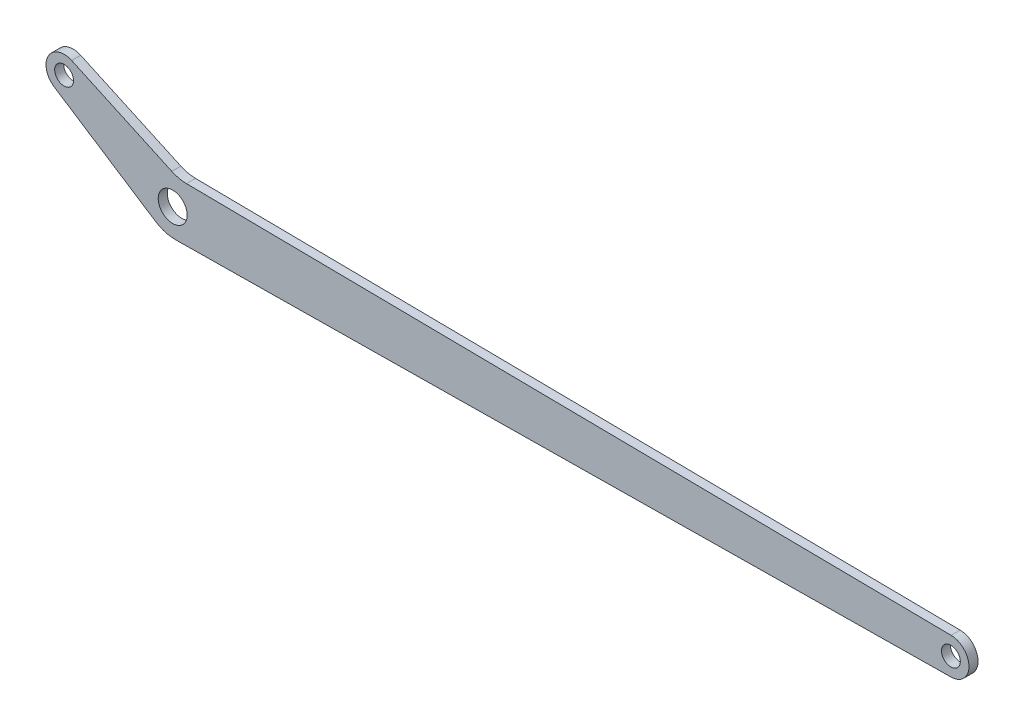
ISO-10303-21;
HEADER;
FILE_DESCRIPTION(('STEP AP214'),'2;1');
FILE_NAME('part.step','',(''),(''),'','','');
FILE_SCHEMA(('AUTOMOTIVE_DESIGN { 1 0 10303 214 1 1 1 1 }'));
ENDSEC;
DATA;
#1=APPLICATION_CONTEXT('core data for automotive mechanical design processes');
#2=APPLICATION_PROTOCOL_DEFINITION('international standard','automotive_design',2000,#1);
#3=PRODUCT_CONTEXT('',#1,'mechanical');
#4=PRODUCT('Part','Part','',(#3));
#5=PRODUCT_RELATED_PRODUCT_CATEGORY('part','',(#4));
#6=PRODUCT_DEFINITION_FORMATION('','',#4);
#7=PRODUCT_DEFINITION_CONTEXT('part definition',#1,'design');
#8=PRODUCT_DEFINITION('design','',#6,#7);
#9=PRODUCT_DEFINITION_SHAPE('','',#8);
#10=(LENGTH_UNIT() NAMED_UNIT(*) SI_UNIT(.MILLI.,.METRE.));
#11=(NAMED_UNIT(*) PLANE_ANGLE_UNIT() SI_UNIT($,.RADIAN.));
#12=(NAMED_UNIT(*) SI_UNIT($,.STERADIAN.) SOLID_ANGLE_UNIT());
#13=UNCERTAINTY_MEASURE_WITH_UNIT(LENGTH_MEASURE(1.E-05),#10,'distance_accuracy_value','');
#14=(GEOMETRIC_REPRESENTATION_CONTEXT(3) GLOBAL_UNCERTAINTY_ASSIGNED_CONTEXT((#13)) GLOBAL_UNIT_ASSIGNED_CONTEXT((#10,
#11,#12)) REPRESENTATION_CONTEXT('',''));
#15=CARTESIAN_POINT('',(0.,0.,0.));
#16=DIRECTION('',(0.,0.,1.));
#17=DIRECTION('',(1.,0.,0.));
#18=AXIS2_PLACEMENT_3D('',#15,#16,#17);
#19=CARTESIAN_POINT('',(0.,0.,2.5));
#20=DIRECTION('',(0.,0.,1.));
#21=DIRECTION('',(1.,0.,0.));
#22=AXIS2_PLACEMENT_3D('',#19,#20,#21);
#23=PLANE('',#22);
#24=CARTESIAN_POINT('',(-215.,0.,2.5));
#25=DIRECTION('',(0.,0.,1.));
#26=DIRECTION('',(1.,0.,0.));
#27=AXIS2_PLACEMENT_3D('',#24,#25,#26);
#28=CIRCLE('',#27,3.99999999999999);
#29=CARTESIAN_POINT('',(-211.,0.,2.5));
#30=VERTEX_POINT('',#29);
#31=EDGE_CURVE('E178',#30,#30,#28,.T.);
#32=ORIENTED_EDGE('',*,*,#31,.F.);
#33=EDGE_LOOP('',(#32));
#34=FACE_BOUND('',#33,.T.);
#35=DIRECTION('',(0.838688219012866,-0.54461185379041,0.));
#36=VECTOR('',#35,1.);
#37=CARTESIAN_POINT('',(-247.723059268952,12.3065589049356,2.5));
#38=LINE('',#37,#36);
#39=CARTESIAN_POINT('',(-247.723059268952,12.3065589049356,2.5));
#40=VERTEX_POINT('',#39);
#41=CARTESIAN_POINT('',(-219.718911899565,-5.87825669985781,2.5));
#42=VERTEX_POINT('',#41);
#43=EDGE_CURVE('E158',#40,#42,#38,.T.);
#44=ORIENTED_EDGE('',*,*,#43,.T.);
#45=CARTESIAN_POINT('',(-214.272793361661,2.50862549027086,2.5));
#46=DIRECTION('',(0.,0.,1.));
#47=DIRECTION('',(1.,0.,0.));
#48=AXIS2_PLACEMENT_3D('',#45,#46,#47);
#49=CIRCLE('',#48,10.);
#50=CARTESIAN_POINT('',(-214.156514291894,-7.49069844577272,2.5));
#51=VERTEX_POINT('',#50);
#52=EDGE_CURVE('E11',#42,#51,#49,.T.);
#53=ORIENTED_EDGE('',*,*,#52,.T.);
#54=DIRECTION('',(0.999932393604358,0.0116279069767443,0.));
#55=VECTOR('',#54,1.);
#56=CARTESIAN_POINT('',(-217.181619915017,-7.5258764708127,2.5));
#57=LINE('',#56,#55);
#58=CARTESIAN_POINT('',(0.0581395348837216,-4.99966196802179,2.5));
#59=VERTEX_POINT('',#58);
#60=EDGE_CURVE('E114',#51,#59,#57,.T.);
#61=ORIENTED_EDGE('',*,*,#60,.T.);
#62=CARTESIAN_POINT('',(0.,0.,2.5));
#63=DIRECTION('',(0.,0.,1.));
#64=DIRECTION('',(1.,0.,0.));
#65=AXIS2_PLACEMENT_3D('',#62,#63,#64);
#66=CIRCLE('',#65,5.);
#67=CARTESIAN_POINT('',(0.0581395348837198,4.99966196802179,2.5));
#68=VERTEX_POINT('',#67);
#69=EDGE_CURVE('E109',#59,#68,#66,.T.);
#70=ORIENTED_EDGE('',*,*,#69,.T.);
#71=DIRECTION('',(-0.999932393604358,0.0116279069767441,0.));
#72=VECTOR('',#71,1.);
#73=CARTESIAN_POINT('',(-213.321651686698,7.48099008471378,2.5));
#74=LINE('',#73,#72);
#75=CARTESIAN_POINT('',(-211.200133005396,7.45631959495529,2.5));
#76=VERTEX_POINT('',#75);
#77=EDGE_CURVE('E97',#68,#76,#74,.T.);
#78=ORIENTED_EDGE('',*,*,#77,.T.);
#79=CARTESIAN_POINT('',(-211.083853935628,17.4556435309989,2.5));
#80=DIRECTION('',(0.,0.,1.));
#81=DIRECTION('',(1.,0.,0.));
#82=AXIS2_PLACEMENT_3D('',#79,#80,#81);
#83=CIRCLE('',#82,10.);
#84=CARTESIAN_POINT('',(-215.250381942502,8.36498654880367,2.5));
#85=VERTEX_POINT('',#84);
#86=EDGE_CURVE('E136',#76,#85,#83,.F.);
#87=ORIENTED_EDGE('',*,*,#86,.T.);
#88=DIRECTION('',(-0.90906569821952,0.416652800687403,0.));
#89=VECTOR('',#88,1.);
#90=CARTESIAN_POINT('',(-242.916735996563,21.0453284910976,2.5));
#91=LINE('',#90,#89);
#92=CARTESIAN_POINT('',(-242.916735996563,21.0453284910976,2.5));
#93=VERTEX_POINT('',#92);
#94=EDGE_CURVE('E108',#85,#93,#91,.T.);
#95=ORIENTED_EDGE('',*,*,#94,.T.);
#96=CARTESIAN_POINT('',(-245.,16.5,2.5));
#97=DIRECTION('',(0.,0.,1.));
#98=DIRECTION('',(1.,0.,0.));
#99=AXIS2_PLACEMENT_3D('',#96,#97,#98);
#100=CIRCLE('',#99,5.);
#101=EDGE_CURVE('E172',#93,#40,#100,.T.);
#102=ORIENTED_EDGE('',*,*,#101,.T.);
#103=EDGE_LOOP('',(#44,#53,#61,#70,#78,#87,#95,#102));
#104=FACE_BOUND('',#103,.T.);
#105=CARTESIAN_POINT('',(0.,0.,2.5));
#106=DIRECTION('',(0.,0.,1.));
#107=DIRECTION('',(1.,0.,0.));
#108=AXIS2_PLACEMENT_3D('',#105,#106,#107);
#109=CIRCLE('',#108,2.6);
#110=CARTESIAN_POINT('',(2.6,0.,2.5));
#111=VERTEX_POINT('',#110);
#112=EDGE_CURVE('E169',#111,#111,#109,.T.);
#113=ORIENTED_EDGE('',*,*,#112,.F.);
#114=EDGE_LOOP('',(#113));
#115=FACE_BOUND('',#114,.T.);
#116=CARTESIAN_POINT('',(-245.,16.5,2.5));
#117=DIRECTION('',(0.,0.,1.));
#118=DIRECTION('',(1.,0.,0.));
#119=AXIS2_PLACEMENT_3D('',#116,#117,#118);
#120=CIRCLE('',#119,2.59999999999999);
#121=CARTESIAN_POINT('',(-242.4,16.5,2.5));
#122=VERTEX_POINT('',#121);
#123=EDGE_CURVE('E184',#122,#122,#120,.T.);
#124=ORIENTED_EDGE('',*,*,#123,.F.);
#125=EDGE_LOOP('',(#124));
#126=FACE_BOUND('',#125,.T.);
#127=ADVANCED_FACE('F32',(#34,#104,#115,#126),#23,.T.);
#128=CARTESIAN_POINT('',(0.,0.,0.));
#129=DIRECTION('',(0.,0.,1.));
#130=DIRECTION('',(1.,0.,0.));
#131=AXIS2_PLACEMENT_3D('',#128,#129,#130);
#132=PLANE('',#131);
#133=DIRECTION('',(0.999932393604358,0.0116279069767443,0.));
#134=VECTOR('',#133,1.);
#135=CARTESIAN_POINT('',(-217.181619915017,-7.5258764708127,0.));
#136=LINE('',#135,#134);
#137=CARTESIAN_POINT('',(-214.156514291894,-7.49069844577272,0.));
#138=VERTEX_POINT('',#137);
#139=CARTESIAN_POINT('',(0.0581395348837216,-4.99966196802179,0.));
#140=VERTEX_POINT('',#139);
#141=EDGE_CURVE('E118',#138,#140,#136,.T.);
#142=ORIENTED_EDGE('',*,*,#141,.F.);
#143=CARTESIAN_POINT('',(-214.272793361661,2.50862549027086,0.));
#144=DIRECTION('',(0.,0.,1.));
#145=DIRECTION('',(1.,0.,0.));
#146=AXIS2_PLACEMENT_3D('',#143,#144,#145);
#147=CIRCLE('',#146,10.);
#148=CARTESIAN_POINT('',(-219.718911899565,-5.87825669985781,0.));
#149=VERTEX_POINT('',#148);
#150=EDGE_CURVE('E54',#138,#149,#147,.F.);
#151=ORIENTED_EDGE('',*,*,#150,.T.);
#152=DIRECTION('',(0.838688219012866,-0.54461185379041,0.));
#153=VECTOR('',#152,1.);
#154=CARTESIAN_POINT('',(-247.723059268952,12.3065589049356,0.));
#155=LINE('',#154,#153);
#156=CARTESIAN_POINT('',(-247.723059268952,12.3065589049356,0.));
#157=VERTEX_POINT('',#156);
#158=EDGE_CURVE('E148',#157,#149,#155,.T.);
#159=ORIENTED_EDGE('',*,*,#158,.F.);
#160=CARTESIAN_POINT('',(-245.,16.5,0.));
#161=DIRECTION('',(0.,0.,1.));
#162=DIRECTION('',(1.,0.,0.));
#163=AXIS2_PLACEMENT_3D('',#160,#161,#162);
#164=CIRCLE('',#163,5.);
#165=CARTESIAN_POINT('',(-242.916735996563,21.0453284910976,0.));
#166=VERTEX_POINT('',#165);
#167=EDGE_CURVE('E150',#166,#157,#164,.T.);
#168=ORIENTED_EDGE('',*,*,#167,.F.);
#169=DIRECTION('',(-0.90906569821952,0.416652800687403,0.));
#170=VECTOR('',#169,1.);
#171=CARTESIAN_POINT('',(-242.916735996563,21.0453284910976,0.));
#172=LINE('',#171,#170);
#173=CARTESIAN_POINT('',(-215.250381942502,8.36498654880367,0.));
#174=VERTEX_POINT('',#173);
#175=EDGE_CURVE('E163',#174,#166,#172,.T.);
#176=ORIENTED_EDGE('',*,*,#175,.F.);
#177=CARTESIAN_POINT('',(-211.083853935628,17.4556435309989,0.));
#178=DIRECTION('',(0.,0.,1.));
#179=DIRECTION('',(1.,0.,0.));
#180=AXIS2_PLACEMENT_3D('',#177,#178,#179);
#181=CIRCLE('',#180,10.);
#182=CARTESIAN_POINT('',(-211.200133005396,7.45631959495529,0.));
#183=VERTEX_POINT('',#182);
#184=EDGE_CURVE('E134',#174,#183,#181,.T.);
#185=ORIENTED_EDGE('',*,*,#184,.T.);
#186=DIRECTION('',(-0.999932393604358,0.0116279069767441,0.));
#187=VECTOR('',#186,1.);
#188=CARTESIAN_POINT('',(-213.321651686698,7.48099008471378,0.));
#189=LINE('',#188,#187);
#190=CARTESIAN_POINT('',(0.0581395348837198,4.99966196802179,0.));
#191=VERTEX_POINT('',#190);
#192=EDGE_CURVE('E164',#191,#183,#189,.T.);
#193=ORIENTED_EDGE('',*,*,#192,.F.);
#194=CARTESIAN_POINT('',(0.,0.,0.));
#195=DIRECTION('',(0.,0.,1.));
#196=DIRECTION('',(1.,0.,0.));
#197=AXIS2_PLACEMENT_3D('',#194,#195,#196);
#198=CIRCLE('',#197,5.);
#199=EDGE_CURVE('E122',#140,#191,#198,.T.);
#200=ORIENTED_EDGE('',*,*,#199,.F.);
#201=EDGE_LOOP('',(#142,#151,#159,#168,#176,#185,#193,#200));
#202=FACE_BOUND('',#201,.T.);
#203=CARTESIAN_POINT('',(0.,0.,0.));
#204=DIRECTION('',(0.,0.,1.));
#205=DIRECTION('',(1.,0.,0.));
#206=AXIS2_PLACEMENT_3D('',#203,#204,#205);
#207=CIRCLE('',#206,2.6);
#208=CARTESIAN_POINT('',(2.6,0.,0.));
#209=VERTEX_POINT('',#208);
#210=EDGE_CURVE('E175',#209,#209,#207,.T.);
#211=ORIENTED_EDGE('',*,*,#210,.T.);
#212=EDGE_LOOP('',(#211));
#213=FACE_BOUND('',#212,.T.);
#214=CARTESIAN_POINT('',(-215.,0.,0.));
#215=DIRECTION('',(0.,0.,1.));
#216=DIRECTION('',(1.,0.,0.));
#217=AXIS2_PLACEMENT_3D('',#214,#215,#216);
#218=CIRCLE('',#217,3.99999999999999);
#219=CARTESIAN_POINT('',(-211.,0.,0.));
#220=VERTEX_POINT('',#219);
#221=EDGE_CURVE('E181',#220,#220,#218,.T.);
#222=ORIENTED_EDGE('',*,*,#221,.T.);
#223=EDGE_LOOP('',(#222));
#224=FACE_BOUND('',#223,.T.);
#225=CARTESIAN_POINT('',(-245.,16.5,0.));
#226=DIRECTION('',(0.,0.,1.));
#227=DIRECTION('',(1.,0.,0.));
#228=AXIS2_PLACEMENT_3D('',#225,#226,#227);
#229=CIRCLE('',#228,2.59999999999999);
#230=CARTESIAN_POINT('',(-242.4,16.5,0.));
#231=VERTEX_POINT('',#230);
#232=EDGE_CURVE('E187',#231,#231,#229,.T.);
#233=ORIENTED_EDGE('',*,*,#232,.T.);
#234=EDGE_LOOP('',(#233));
#235=FACE_BOUND('',#234,.T.);
#236=ADVANCED_FACE('F146',(#202,#213,#224,#235),#132,.F.);
#237=CARTESIAN_POINT('',(0.,0.,2.5));
#238=DIRECTION('',(0.,0.,-1.));
#239=DIRECTION('',(-1.,0.,0.));
#240=AXIS2_PLACEMENT_3D('',#237,#238,#239);
#241=CYLINDRICAL_SURFACE('',#240,5.);
#242=ORIENTED_EDGE('',*,*,#199,.T.);
#243=DIRECTION('',(0.,0.,-1.));
#244=VECTOR('',#243,1.);
#245=CARTESIAN_POINT('',(0.0581395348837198,4.99966196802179,2.5));
#246=LINE('',#245,#244);
#247=EDGE_CURVE('E102',#68,#191,#246,.T.);
#248=ORIENTED_EDGE('',*,*,#247,.F.);
#249=ORIENTED_EDGE('',*,*,#69,.F.);
#250=DIRECTION('',(0.,0.,-1.));
#251=VECTOR('',#250,1.);
#252=CARTESIAN_POINT('',(0.0581395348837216,-4.99966196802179,2.5));
#253=LINE('',#252,#251);
#254=EDGE_CURVE('E154',#59,#140,#253,.T.);
#255=ORIENTED_EDGE('',*,*,#254,.T.);
#256=EDGE_LOOP('',(#242,#248,#249,#255));
#257=FACE_BOUND('',#256,.T.);
#258=ADVANCED_FACE('F120',(#257),#241,.T.);
#259=CARTESIAN_POINT('',(-213.321651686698,7.48099008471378,2.5));
#260=DIRECTION('',(-0.0116279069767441,-0.999932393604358,0.));
#261=DIRECTION('',(0.999932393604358,-0.0116279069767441,0.));
#262=AXIS2_PLACEMENT_3D('',#259,#260,#261);
#263=PLANE('',#262);
#264=ORIENTED_EDGE('',*,*,#192,.T.);
#265=DIRECTION('',(0.,0.,-1.));
#266=VECTOR('',#265,1.);
#267=CARTESIAN_POINT('',(-211.200133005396,7.45631959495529,2.5));
#268=LINE('',#267,#266);
#269=EDGE_CURVE('E105',#183,#76,#268,.F.);
#270=ORIENTED_EDGE('',*,*,#269,.T.);
#271=ORIENTED_EDGE('',*,*,#77,.F.);
#272=ORIENTED_EDGE('',*,*,#247,.T.);
#273=EDGE_LOOP('',(#264,#270,#271,#272));
#274=FACE_BOUND('',#273,.T.);
#275=ADVANCED_FACE('F100',(#274),#263,.F.);
#276=CARTESIAN_POINT('',(-242.916735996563,21.0453284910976,2.5));
#277=DIRECTION('',(-0.416652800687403,-0.90906569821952,0.));
#278=DIRECTION('',(0.90906569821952,-0.416652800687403,0.));
#279=AXIS2_PLACEMENT_3D('',#276,#277,#278);
#280=PLANE('',#279);
#281=ORIENTED_EDGE('',*,*,#94,.F.);
#282=DIRECTION('',(0.,0.,-1.));
#283=VECTOR('',#282,1.);
#284=CARTESIAN_POINT('',(-215.250381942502,8.36498654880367,0.));
#285=LINE('',#284,#283);
#286=EDGE_CURVE('E123',#85,#174,#285,.T.);
#287=ORIENTED_EDGE('',*,*,#286,.T.);
#288=ORIENTED_EDGE('',*,*,#175,.T.);
#289=DIRECTION('',(0.,0.,-1.));
#290=VECTOR('',#289,1.);
#291=CARTESIAN_POINT('',(-242.916735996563,21.0453284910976,2.5));
#292=LINE('',#291,#290);
#293=EDGE_CURVE('E124',#93,#166,#292,.T.);
#294=ORIENTED_EDGE('',*,*,#293,.F.);
#295=EDGE_LOOP('',(#281,#287,#288,#294));
#296=FACE_BOUND('',#295,.T.);
#297=ADVANCED_FACE('F215',(#296),#280,.F.);
#298=CARTESIAN_POINT('',(-245.,16.5,2.5));
#299=DIRECTION('',(0.,0.,-1.));
#300=DIRECTION('',(-1.,0.,0.));
#301=AXIS2_PLACEMENT_3D('',#298,#299,#300);
#302=CYLINDRICAL_SURFACE('',#301,5.);
#303=ORIENTED_EDGE('',*,*,#167,.T.);
#304=DIRECTION('',(0.,0.,-1.));
#305=VECTOR('',#304,1.);
#306=CARTESIAN_POINT('',(-247.723059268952,12.3065589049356,2.5));
#307=LINE('',#306,#305);
#308=EDGE_CURVE('E129',#40,#157,#307,.T.);
#309=ORIENTED_EDGE('',*,*,#308,.F.);
#310=ORIENTED_EDGE('',*,*,#101,.F.);
#311=ORIENTED_EDGE('',*,*,#293,.T.);
#312=EDGE_LOOP('',(#303,#309,#310,#311));
#313=FACE_BOUND('',#312,.T.);
#314=ADVANCED_FACE('F212',(#313),#302,.T.);
#315=CARTESIAN_POINT('',(-247.723059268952,12.3065589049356,2.5));
#316=DIRECTION('',(0.54461185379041,0.838688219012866,0.));
#317=DIRECTION('',(-0.838688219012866,0.54461185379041,0.));
#318=AXIS2_PLACEMENT_3D('',#315,#316,#317);
#319=PLANE('',#318);
#320=ORIENTED_EDGE('',*,*,#158,.T.);
#321=DIRECTION('',(0.,0.,-1.));
#322=VECTOR('',#321,1.);
#323=CARTESIAN_POINT('',(-219.718911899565,-5.87825669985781,2.5));
#324=LINE('',#323,#322);
#325=EDGE_CURVE('E40',#149,#42,#324,.F.);
#326=ORIENTED_EDGE('',*,*,#325,.T.);
#327=ORIENTED_EDGE('',*,*,#43,.F.);
#328=ORIENTED_EDGE('',*,*,#308,.T.);
#329=EDGE_LOOP('',(#320,#326,#327,#328));
#330=FACE_BOUND('',#329,.T.);
#331=ADVANCED_FACE('F157',(#330),#319,.F.);
#332=CARTESIAN_POINT('',(-217.181619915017,-7.5258764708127,2.5));
#333=DIRECTION('',(-0.0116279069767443,0.999932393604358,0.));
#334=DIRECTION('',(-0.999932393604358,-0.0116279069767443,0.));
#335=AXIS2_PLACEMENT_3D('',#332,#333,#334);
#336=PLANE('',#335);
#337=ORIENTED_EDGE('',*,*,#60,.F.);
#338=DIRECTION('',(0.,0.,-1.));
#339=VECTOR('',#338,1.);
#340=CARTESIAN_POINT('',(-214.156514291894,-7.49069844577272,2.5));
#341=LINE('',#340,#339);
#342=EDGE_CURVE('E138',#51,#138,#341,.T.);
#343=ORIENTED_EDGE('',*,*,#342,.T.);
#344=ORIENTED_EDGE('',*,*,#141,.T.);
#345=ORIENTED_EDGE('',*,*,#254,.F.);
#346=EDGE_LOOP('',(#337,#343,#344,#345));
#347=FACE_BOUND('',#346,.T.);
#348=ADVANCED_FACE('F143',(#347),#336,.F.);
#349=CARTESIAN_POINT('',(0.,0.,2.5));
#350=DIRECTION('',(0.,0.,-1.));
#351=DIRECTION('',(-1.,0.,0.));
#352=AXIS2_PLACEMENT_3D('',#349,#350,#351);
#353=CYLINDRICAL_SURFACE('',#352,2.6);
#354=ORIENTED_EDGE('',*,*,#112,.T.);
#355=EDGE_LOOP('',(#354));
#356=FACE_BOUND('',#355,.T.);
#357=ORIENTED_EDGE('',*,*,#210,.F.);
#358=EDGE_LOOP('',(#357));
#359=FACE_BOUND('',#358,.T.);
#360=ADVANCED_FACE('F205',(#356,#359),#353,.F.);
#361=CARTESIAN_POINT('',(-215.,0.,2.5));
#362=DIRECTION('',(0.,0.,-1.));
#363=DIRECTION('',(-1.,0.,0.));
#364=AXIS2_PLACEMENT_3D('',#361,#362,#363);
#365=CYLINDRICAL_SURFACE('',#364,3.99999999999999);
#366=ORIENTED_EDGE('',*,*,#31,.T.);
#367=EDGE_LOOP('',(#366));
#368=FACE_BOUND('',#367,.T.);
#369=ORIENTED_EDGE('',*,*,#221,.F.);
#370=EDGE_LOOP('',(#369));
#371=FACE_BOUND('',#370,.T.);
#372=ADVANCED_FACE('F229',(#368,#371),#365,.F.);
#373=CARTESIAN_POINT('',(-245.,16.5,2.5));
#374=DIRECTION('',(0.,0.,-1.));
#375=DIRECTION('',(-1.,0.,0.));
#376=AXIS2_PLACEMENT_3D('',#373,#374,#375);
#377=CYLINDRICAL_SURFACE('',#376,2.59999999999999);
#378=ORIENTED_EDGE('',*,*,#123,.T.);
#379=EDGE_LOOP('',(#378));
#380=FACE_BOUND('',#379,.T.);
#381=ORIENTED_EDGE('',*,*,#232,.F.);
#382=EDGE_LOOP('',(#381));
#383=FACE_BOUND('',#382,.T.);
#384=ADVANCED_FACE('F193',(#380,#383),#377,.F.);
#385=CARTESIAN_POINT('',(-211.083853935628,17.4556435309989,2.5));
#386=DIRECTION('',(0.,0.,1.));
#387=DIRECTION('',(1.,0.,0.));
#388=AXIS2_PLACEMENT_3D('',#385,#386,#387);
#389=CYLINDRICAL_SURFACE('',#388,10.);
#390=ORIENTED_EDGE('',*,*,#86,.F.);
#391=ORIENTED_EDGE('',*,*,#269,.F.);
#392=ORIENTED_EDGE('',*,*,#184,.F.);
#393=ORIENTED_EDGE('',*,*,#286,.F.);
#394=EDGE_LOOP('',(#390,#391,#392,#393));
#395=FACE_BOUND('',#394,.T.);
#396=ADVANCED_FACE('F222',(#395),#389,.F.);
#397=CARTESIAN_POINT('',(-214.272793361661,2.50862549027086,2.5));
#398=DIRECTION('',(0.,0.,-1.));
#399=DIRECTION('',(-1.,0.,0.));
#400=AXIS2_PLACEMENT_3D('',#397,#398,#399);
#401=CYLINDRICAL_SURFACE('',#400,10.);
#402=ORIENTED_EDGE('',*,*,#52,.F.);
#403=ORIENTED_EDGE('',*,*,#325,.F.);
#404=ORIENTED_EDGE('',*,*,#150,.F.);
#405=ORIENTED_EDGE('',*,*,#342,.F.);
#406=EDGE_LOOP('',(#402,#403,#404,#405));
#407=FACE_BOUND('',#406,.T.);
#408=ADVANCED_FACE('F34',(#407),#401,.T.);
#409=CLOSED_SHELL('',(#127,#236,#258,#275,#297,#314,#331,#348,#360,#372,#384,#396,#408));
#410=MANIFOLD_SOLID_BREP('B2',#409);
#411=ADVANCED_BREP_SHAPE_REPRESENTATION('',(#18,#410),#14);
#412=SHAPE_DEFINITION_REPRESENTATION(#9,#411);
ENDSEC;
END-ISO-10303-21;
